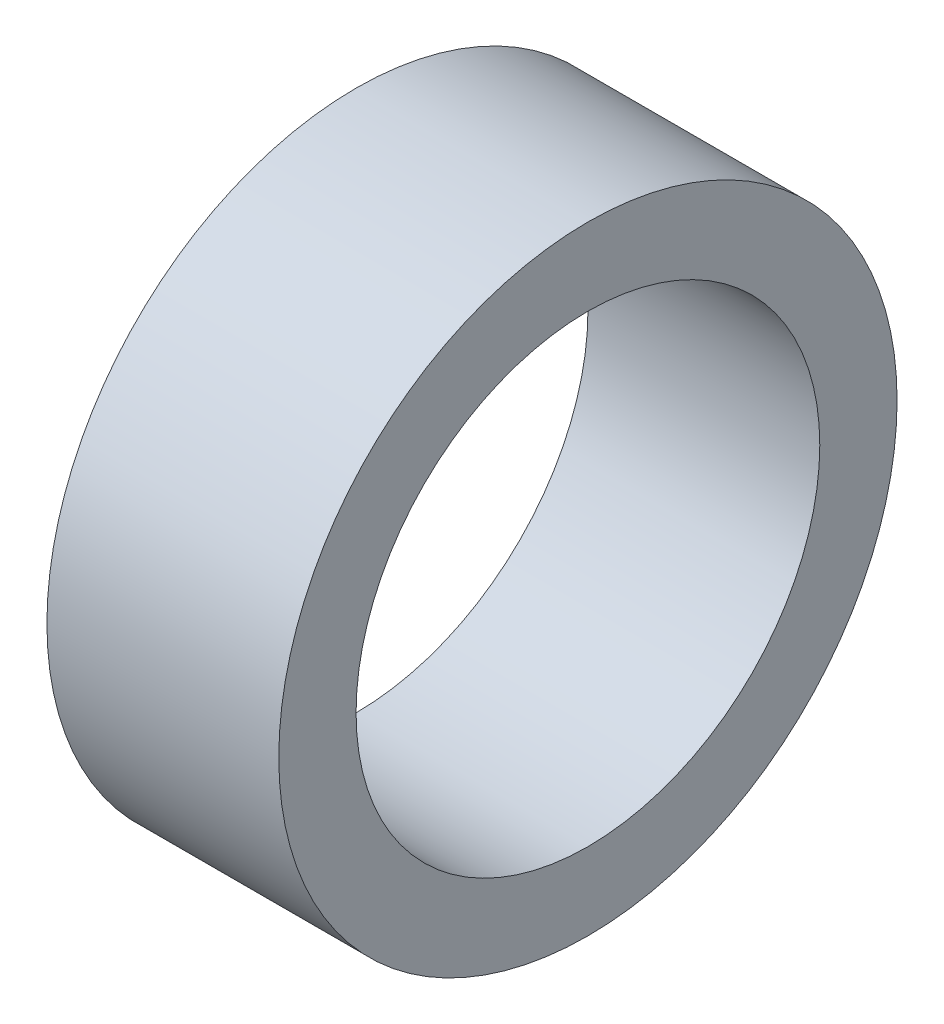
from build123d import *

# Parameters (mm, degrees)
CROQUIS1_R              = 20
CROQUIS1_R_2            = 15
SALIENTE_EXTRUIR1_DEPTH = 15


with BuildPart() as part:
    # Croquis1 → Saliente-Extruir1 (new body)
    with BuildSketch(Plane(origin=(0, 0, 0), x_dir=(0, 0, -1), z_dir=(1, 0, 0))):
        Circle(CROQUIS1_R)
        Circle(CROQUIS1_R_2, mode=Mode.SUBTRACT)
    extrude(amount=SALIENTE_EXTRUIR1_DEPTH)


solid = part.part
